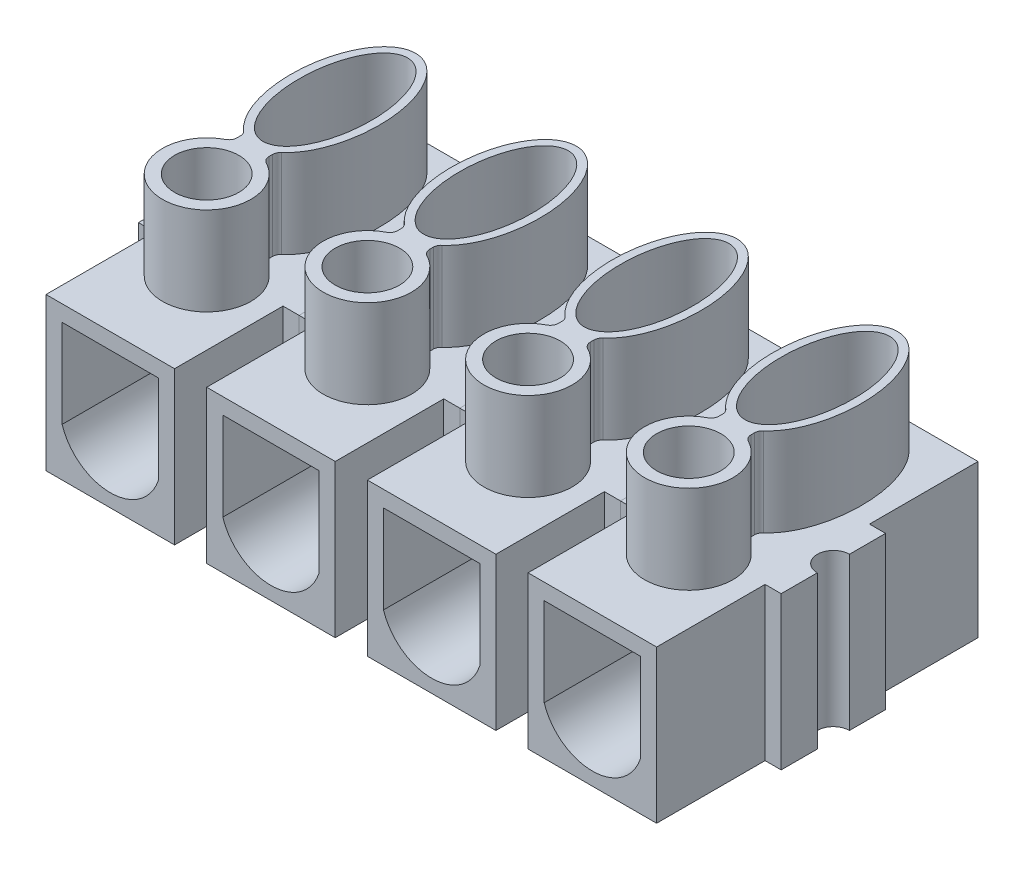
from build123d import *

# Parameters (mm, degrees)
ESQUISSE1_W                = 8
ESQUISSE1_H                = 9.5
EXTRUSION1_DEPTH           = 10
ESQUISSE2_W                = 6.5
ESQUISSE2_H                = 9.5
EXTRUSION2_DEPTH           = 1
ENL_V_MAT_EXTRU_1_DEPTH    = 15.671400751
ESQUISSE4_R                = 2
ENL_V_MAT_EXTRU_2_DEPTH    = 3
EXTRUSION3_START           = 5.5
ESQUISSE5_R                = 2.75
ESQUISSE5_R_2              = 2
EXTRUSION3_DEPTH           = 5.5
ESQUISSE6_RX               = 5
ESQUISSE6_RY               = 2.75
ESQUISSE6_RX_2             = 4.5
ESQUISSE6_RY_2             = 2.25
EXTRUSION4_DEPTH           = 5.5
EXTRUSION5_START           = 0.5
ESQUISSE7_W                = 2
ESQUISSE7_H                = 5.5
EXTRUSION5_DEPTH           = 1
CONG_1_R                   = 0.5
R_P_TITION_LIN_AIRE3_COUNT = 4
R_P_TITION_LIN_AIRE3_PITCH = 10


with BuildPart() as part:
    # Esquisse1 → Extrusion1 (new, symmetric)
    with BuildSketch(Plane.XY):
        with Locations((0, -4.75)):
            Rectangle(ESQUISSE1_W, ESQUISSE1_H)
        with BuildLine():
            Line((-2.997406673, -1), (3, -1))
            Line((3, -1), (3, -6.5))
            ThreePointArc((3, -6.5), (0.001296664, -8.685490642), (-2.997406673, -6.5))
            Line((-2.997406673, -6.5), (-2.997406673, -1))
        make_face(mode=Mode.SUBTRACT)
    extrude(amount=EXTRUSION1_DEPTH, both=True)

    # Esquisse2 → Extrusion2 (add)
    with BuildSketch(Plane(origin=(4, 0, 0), x_dir=(0, 0, -1), z_dir=(1, 0, 0))):
        with Locations((0, -4.75)):
            Rectangle(ESQUISSE2_W, ESQUISSE2_H)
    extrusion2 = extrude(amount=EXTRUSION2_DEPTH)

    # Sym_trie1: Extrusion2 across plane
    add(extrusion2.mirror(Plane(origin=(0, 0, 0), x_dir=(0, 0, 1), z_dir=(1, 0, 0))))

    # Esquisse3 → Enl_v. mat.-Extru.1 (cut, through all)
    with BuildSketch(Plane(origin=(0, 0, 0), x_dir=(-1, 0, 0), z_dir=(0, 1, 0))):
        with BuildLine():
            Line((-5, 1), (-5, -1))
            ThreePointArc((-5, -1), (-4, 0), (-5, 1))
        make_face()
        with BuildLine():
            Line((5, 1), (5, -1))
            ThreePointArc((5, -1), (4, 0), (5, 1))
        make_face()
    extrude(amount=-ENL_V_MAT_EXTRU_1_DEPTH, mode=Mode.SUBTRACT)

    # Esquisse4 → Enl_v. mat.-Extru.2 (cut)
    with BuildSketch(Plane(origin=(0, 0, 0), x_dir=(-1, 0, 0), z_dir=(0, 1, 0))):
        with Locations(Location((0, 4, 0), (0, 0, 90))):
            Circle(ESQUISSE4_R)
        with Locations(Location((0, -4, 0), (0, 0, 90))):
            Circle(ESQUISSE4_R)
    extrude(amount=-ENL_V_MAT_EXTRU_2_DEPTH, mode=Mode.SUBTRACT)

    # Esquisse5 → Extrusion3 (add)
    with BuildSketch(Plane(origin=(0, 0, 0), x_dir=(-1, 0, 0), z_dir=(0, 1, 0)).offset(EXTRUSION3_START)):
        with Locations(Location((0, 4, 0), (0, 0, 270))):
            Circle(ESQUISSE5_R)
        with Locations(Location((0, 4, 0), (0, 0, 90))):
            Circle(ESQUISSE5_R_2, mode=Mode.SUBTRACT)
    extrude(amount=-EXTRUSION3_DEPTH)

    # Esquisse6 → Extrusion4 (add)
    with BuildSketch(Plane(origin=(0, 0, 0), x_dir=(-1, 0, 0), z_dir=(0, 1, 0))):
        with Locations(Location((0, -4), (0, 0, -90))):
            Ellipse(ESQUISSE6_RX, ESQUISSE6_RY)
        with Locations(Location((0, -4), (0, 0, -90))):
            Ellipse(ESQUISSE6_RX_2, ESQUISSE6_RY_2, mode=Mode.SUBTRACT)
    extrude(amount=EXTRUSION4_DEPTH)

    # Esquisse7 → Extrusion5 (add)
    with BuildSketch(Plane.XY.offset(EXTRUSION5_START)):
        with Locations((0, 2.75)):
            Rectangle(ESQUISSE7_W, ESQUISSE7_H)
    extrude(amount=EXTRUSION5_DEPTH)

    # Cong_1
    cong_1_edges = [part.edges().sort_by_distance(p)[0] for p in [
        (-1, 2.75, 1.438262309),
        (-1, 2.75, 0.657704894),
        (1, 2.75, 0.657704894),
        (1, 2.75, 1.438262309),
    ]]
    fillet(cong_1_edges, radius=CONG_1_R)


with BuildPart() as r_p_tition_lin_aire3_1:
    # R_p_tition lin_aire3: pattern copy
    add(part.part.moved(Location(Vector(1, 0, 0) * (1 * R_P_TITION_LIN_AIRE3_PITCH))))


with BuildPart() as r_p_tition_lin_aire3_2:
    # R_p_tition lin_aire3: pattern copy
    add(part.part.moved(Location(Vector(1, 0, 0) * (2 * R_P_TITION_LIN_AIRE3_PITCH))))


with BuildPart() as r_p_tition_lin_aire3_3:
    # R_p_tition lin_aire3: pattern copy
    add(part.part.moved(Location(Vector(1, 0, 0) * (3 * R_P_TITION_LIN_AIRE3_PITCH))))


solid = Compound([part.part, r_p_tition_lin_aire3_1.part, r_p_tition_lin_aire3_2.part, r_p_tition_lin_aire3_3.part])
